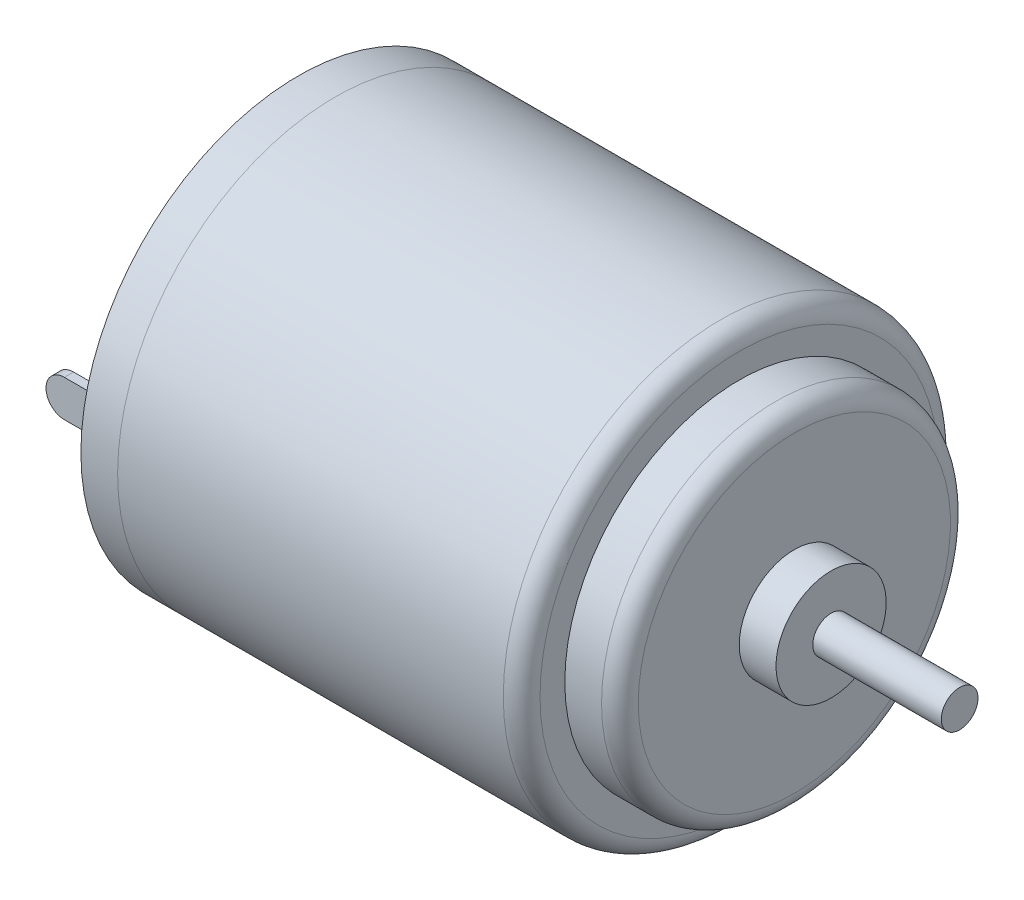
from build123d import *

# Parameters (mm, degrees)
EXTRUDE_1_DEPTH      = 7
EXTRUDE_1_DEPTH_BACK = 32
SKETCH_3_R           = 1
EXTRUDE_2_DEPTH      = 0.5
FILLET_1_R           = 1


with BuildPart() as part:
    # Sketch 1 → Revolve 1 (revolve)
    with BuildSketch(Plane.XY, mode=Mode.PRIVATE) as revolve_1_sk:
        Polygon((0, 0), (27, 0), (27, 3), (25, 3), (25, 9.5), (22, 9.5), (22, 11.85), (0, 11.85), align=None)
    revolve(revolve_1_sk.sketch.rotate(Axis((0, 0, 0), (1, 0, 0)), 90), axis=Axis((0, 0, 0), (1, 0, 0)))

    # Fillet 1
    fillet_1_edges = [part.edges().sort_by_distance(p)[0] for p in [
        (25, 0, -9.5),
        (22, 0, -11.85),
    ]]
    fillet(fillet_1_edges, radius=FILLET_1_R)


with BuildPart() as body_2:
    # Sketch 2 → Revolve 2 (revolve)
    with BuildSketch(Plane.XY, mode=Mode.PRIVATE) as revolve_2_sk:
        Polygon((0, 0), (0, 11.85), (-2, 11.85), (-2, 4.25), (-4, 4.25), (-4, 0), align=None)
    revolve(revolve_2_sk.sketch.rotate(Axis((-4, 0, 0), (1, 0, 0)), 90), axis=Axis((-4, 0, 0), (1, 0, 0)))

    # Sketch 5 → Extrude 2 (add)
    with BuildSketch(Plane.XY.offset(9.25)):
        with BuildLine():
            Line((-2, -1), (-5, -1))
            ThreePointArc((-5, -1), (-6, 0), (-5, 1))
            Line((-5, 1), (-2, 1))
            Line((-2, 1), (-2, -1))
        make_face()
    extrude_2 = extrude(amount=EXTRUDE_2_DEPTH)

    # Mirror 1: Extrude 2 across plane
    add(extrude_2.mirror(Plane.XY))


with BuildPart() as body_3:
    # Sketch 3 → Extrude 1 (new, two sides: drawn at the far end of the back side and taken through both)
    with BuildSketch(Plane(origin=(27, 0, 0), x_dir=(0, 0, -1), z_dir=(1, 0, 0)).offset(-EXTRUDE_1_DEPTH_BACK)):
        Circle(SKETCH_3_R)
    extrude(amount=EXTRUDE_1_DEPTH + EXTRUDE_1_DEPTH_BACK)


solid = Compound([part.part, body_2.part, body_3.part])
